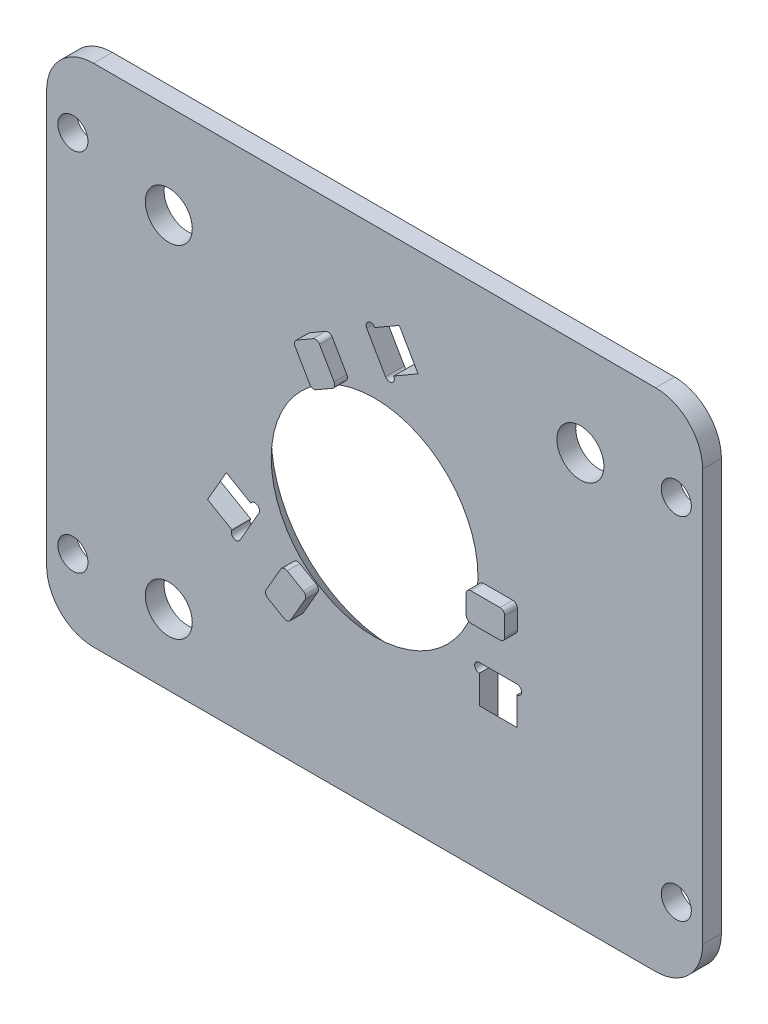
from build123d import *

# Parameters (mm, degrees)
SKETCH_1_W          = 76
SKETCH_1_H          = 60
EXTRUDE_1_DEPTH     = 2
EXTRUDE_2_DEPTH     = 3.35
SKETCH_2_W          = 76
SKETCH_2_H          = 60
CUT_EXTRUDE_1_DEPTH = 2.95
SKETCH_3_R          = 1.715
CUT_EXTRUDE_2_DEPTH = 10
SKETCH_5_R          = 1.6
CUT_EXTRUDE_3_DEPTH = 45.193605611
SKETCH_6_R          = 2.5
CUT_EXTRUDE_4_DEPTH = 45.111815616
CUT_EXTRUDE_5_DEPTH = 4
CUT_EXTRUDE_6_DEPTH = 4
CUT_EXTRUDE_7_DEPTH = 4


with BuildPart() as part:
    # Sketch 1 → Extrude 1 (new body)
    with BuildSketch(Plane.XY):
        Rectangle(SKETCH_1_W, SKETCH_1_H)
        with BuildLine():
            Line((-6.042909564, -9.905650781), (-7.592909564, -12.590329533))
            ThreePointArc((-7.592909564, -12.590329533), (-7.896512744, -12.823292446), (-8.275922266, -12.773342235))
            Line((-8.275922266, -12.773342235), (-10.007973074, -11.773342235))
            ThreePointArc((-10.007973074, -11.773342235), (-10.240935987, -11.469739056), (-10.190985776, -11.090329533))
            Line((-10.190985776, -11.090329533), (-8.640985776, -8.405650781))
            ThreePointArc((-8.640985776, -8.405650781), (-8.337382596, -8.172687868), (-7.957973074, -8.22263808))
            Line((-7.957973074, -8.22263808), (-6.225922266, -9.22263808))
            ThreePointArc((-6.225922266, -9.22263808), (-5.992959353, -9.526241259), (-6.042909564, -9.905650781))
        make_face(mode=Mode.SUBTRACT)
        with BuildLine():
            ThreePointArc((-14.313100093, -9.230040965), (-14.996112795, -9.413053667), (-15.179125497, -8.730040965))
            Line((-15.179125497, -8.730040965), (-13.179125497, -5.26593935))
            ThreePointArc((-13.179125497, -5.26593935), (-12.496112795, -5.082926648), (-12.313100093, -5.76593935))
            Line((-12.313100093, -5.76593935), (-14.313100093, -9.230040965))
        make_face(mode=Mode.SUBTRACT)
        with BuildLine():
            ThreePointArc((11.146484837, -8.780487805), (10.646484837, -8.280487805), (11.146484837, -7.780487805))
            Line((11.146484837, -7.780487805), (15.146484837, -7.780487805))
            ThreePointArc((15.146484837, -7.780487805), (15.646484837, -8.280487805), (15.146484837, -8.780487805))
            Line((15.146484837, -8.780487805), (11.146484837, -8.780487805))
        make_face(mode=Mode.SUBTRACT)
        with BuildLine():
            Line((-5.557090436, 10.186138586), (-7.107090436, 12.870817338))
            ThreePointArc((-7.107090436, 12.870817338), (-7.157040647, 13.250226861), (-6.924077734, 13.55383004))
            Line((-6.924077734, 13.55383004), (-5.192026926, 14.55383004))
            ThreePointArc((-5.192026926, 14.55383004), (-4.812617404, 14.603780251), (-4.509014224, 14.370817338))
            Line((-4.509014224, 14.370817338), (-2.959014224, 11.686138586))
            ThreePointArc((-2.959014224, 11.686138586), (-2.909064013, 11.306729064), (-3.142026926, 11.003125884))
            Line((-3.142026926, 11.003125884), (-4.874077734, 10.003125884))
            ThreePointArc((-4.874077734, 10.003125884), (-5.253487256, 9.953175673), (-5.557090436, 10.186138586))
        make_face(mode=Mode.SUBTRACT)
        with BuildLine():
            Line((1.163100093, 13.546427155), (-0.836899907, 17.01052877))
            ThreePointArc((-0.836899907, 17.01052877), (-0.653887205, 17.693541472), (0.029125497, 17.51052877))
            Line((0.029125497, 17.51052877), (2.029125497, 14.046427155))
            ThreePointArc((2.029125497, 14.046427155), (1.846112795, 13.363414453), (1.163100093, 13.546427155))
        make_face(mode=Mode.SUBTRACT)
    extrude(amount=EXTRUDE_1_DEPTH)

    # Sketch 1_3 → Extrude 2 (add)
    with BuildSketch(Plane.XY):
        with BuildLine():
            Line((14.696484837, -0.280487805), (11.596484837, -0.280487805))
            ThreePointArc((11.596484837, -0.280487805), (11.242931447, -0.426934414), (11.096484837, -0.780487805))
            Line((11.096484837, -0.780487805), (11.096484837, -2.780487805))
            ThreePointArc((11.096484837, -2.780487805), (11.242931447, -3.134041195), (11.596484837, -3.280487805))
            Line((11.596484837, -3.280487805), (14.696484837, -3.280487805))
            ThreePointArc((14.696484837, -3.280487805), (15.050038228, -3.134041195), (15.196484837, -2.780487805))
            Line((15.196484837, -2.780487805), (15.196484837, -0.780487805))
            ThreePointArc((15.196484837, -0.780487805), (15.050038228, -0.426934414), (14.696484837, -0.280487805))
        make_face()
        with BuildLine():
            Line((-7.592909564, -12.590329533), (-6.042909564, -9.905650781))
            ThreePointArc((-6.042909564, -9.905650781), (-5.992959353, -9.526241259), (-6.225922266, -9.22263808))
            Line((-6.225922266, -9.22263808), (-7.957973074, -8.22263808))
            ThreePointArc((-7.957973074, -8.22263808), (-8.337382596, -8.172687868), (-8.640985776, -8.405650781))
            Line((-8.640985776, -8.405650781), (-10.190985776, -11.090329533))
            ThreePointArc((-10.190985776, -11.090329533), (-10.240935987, -11.469739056), (-10.007973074, -11.773342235))
            Line((-10.007973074, -11.773342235), (-8.275922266, -12.773342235))
            ThreePointArc((-8.275922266, -12.773342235), (-7.896512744, -12.823292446), (-7.592909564, -12.590329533))
        make_face()
        with BuildLine():
            Line((-7.107090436, 12.870817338), (-5.557090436, 10.186138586))
            ThreePointArc((-5.557090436, 10.186138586), (-5.253487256, 9.953175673), (-4.874077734, 10.003125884))
            Line((-4.874077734, 10.003125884), (-3.142026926, 11.003125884))
            ThreePointArc((-3.142026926, 11.003125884), (-2.909064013, 11.306729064), (-2.959014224, 11.686138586))
            Line((-2.959014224, 11.686138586), (-4.509014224, 14.370817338))
            ThreePointArc((-4.509014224, 14.370817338), (-4.812617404, 14.603780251), (-5.192026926, 14.55383004))
            Line((-5.192026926, 14.55383004), (-6.924077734, 13.55383004))
            ThreePointArc((-6.924077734, 13.55383004), (-7.157040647, 13.250226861), (-7.107090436, 12.870817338))
        make_face()
    extrude(amount=EXTRUDE_2_DEPTH)

    # Sketch 2 → Cut-Extrude 1 (cut)
    with BuildSketch(Plane(origin=(0, 0, 0), x_dir=(-1, 0, 0), z_dir=(0, 0, -1))):
        Rectangle(SKETCH_2_W, SKETCH_2_H)
        with BuildLine():
            ThreePointArc((-29.9, 26.904317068), (-33.435533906, 25.439850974), (-34.9, 21.904317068))
            Line((-34.9, 21.904317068), (-34.9, -21.9))
            ThreePointArc((-34.9, -21.9), (-33.435533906, -25.435533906), (-29.9, -26.9))
            Line((-29.9, -26.9), (29.9, -26.9))
            ThreePointArc((29.9, -26.9), (33.435533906, -25.435533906), (34.9, -21.9))
            Line((34.9, -21.9), (34.9, 21.904317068))
            ThreePointArc((34.9, 21.904317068), (33.435533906, 25.439850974), (29.9, 26.904317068))
            Line((29.9, 26.904317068), (-29.9, 26.904317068))
        make_face(mode=Mode.SUBTRACT)
    extrude(amount=-CUT_EXTRUDE_1_DEPTH, mode=Mode.SUBTRACT)

    # Sketch 3 → Cut-Extrude 2 (cut)
    with BuildSketch(Plane(origin=(0, 0, 0), x_dir=(-1, 0, 0), z_dir=(0, 0, -1))):
        Circle(SKETCH_3_R)
    extrude(amount=-CUT_EXTRUDE_2_DEPTH, mode=Mode.SUBTRACT)

    # Sketch 4 → Cut-Revolve 1 (revolve, cut)
    with BuildSketch(Plane(origin=(0, 0, 0), x_dir=(1, 0, 0), z_dir=(0, 1, 0)), mode=Mode.PRIVATE) as cut_revolve_1_sk:
        Polygon((0, -2), (11, -2), (13, 0), (0, 0), align=None)
    revolve(cut_revolve_1_sk.sketch.rotate(Axis((0, 0, -2.897060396), (0, 0, 1)), 180), axis=Axis((0, 0, -2.897060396), (0, 0, 1)), mode=Mode.SUBTRACT)

    # Sketch 5 → Cut-Extrude 3 (cut, through all)
    with BuildSketch(Plane.XY):
        with Locations((32.1, 17.904317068)):
            Circle(SKETCH_5_R)
        with Locations((-32.1, 19.404317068)):
            Circle(SKETCH_5_R)
        with Locations(Location((-32.1, -19.4, 0), (0, 0, 180))):
            Circle(SKETCH_5_R)
        with Locations((32.1, -19.4)):
            Circle(SKETCH_5_R)
    extrude(amount=CUT_EXTRUDE_3_DEPTH, mode=Mode.SUBTRACT)

    # Sketch 6 → Cut-Extrude 4 (cut, through all)
    with BuildSketch(Plane.XY.offset(2)):
        with Locations((-21.9, 16.904317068)):
            Circle(SKETCH_6_R)
        with Locations(Location((21.9, 16.904317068, 0), (0, 0, 180))):
            Circle(SKETCH_6_R)
        with Locations((-21.9, -19.4)):
            Circle(SKETCH_6_R)
    extrude(amount=-CUT_EXTRUDE_4_DEPTH, mode=Mode.SUBTRACT)

    # Sketch 7 → Cut-Extrude 5 (cut)
    with BuildSketch(Plane.ZY.offset(-11.146484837)):
        Polygon((2, -8.780487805), (2, -11.780487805), (0, -13.780487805), (0, -8.780487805), align=None)
    extrude(amount=-CUT_EXTRUDE_5_DEPTH, mode=Mode.SUBTRACT)

    # Sketch 8 → Cut-Extrude 6 (cut)
    with BuildSketch(Plane(origin=(-5.575, -9.656183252, 0), x_dir=(0.8660254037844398, -0.499999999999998, 0), z_dir=(0.49999999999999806, 0.8660254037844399, 0))):
        Polygon((-8.780487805, -2), (-8.780487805, 0), (-13.780487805, 0), (-11.780487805, -2), align=None)
    extrude(amount=-CUT_EXTRUDE_6_DEPTH, mode=Mode.SUBTRACT)

    # Sketch 9 → Cut-Extrude 7 (cut)
    with BuildSketch(Plane(origin=(-5.575, 9.656183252, 0), x_dir=(-0.8660254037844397, -0.49999999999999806, 0), z_dir=(0.49999999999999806, -0.8660254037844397, 0))):
        Polygon((-8.780487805, -2), (-8.780487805, 0), (-13.780487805, 0), (-11.780487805, -2), align=None)
    extrude(amount=-CUT_EXTRUDE_7_DEPTH, mode=Mode.SUBTRACT)


solid = part.part
